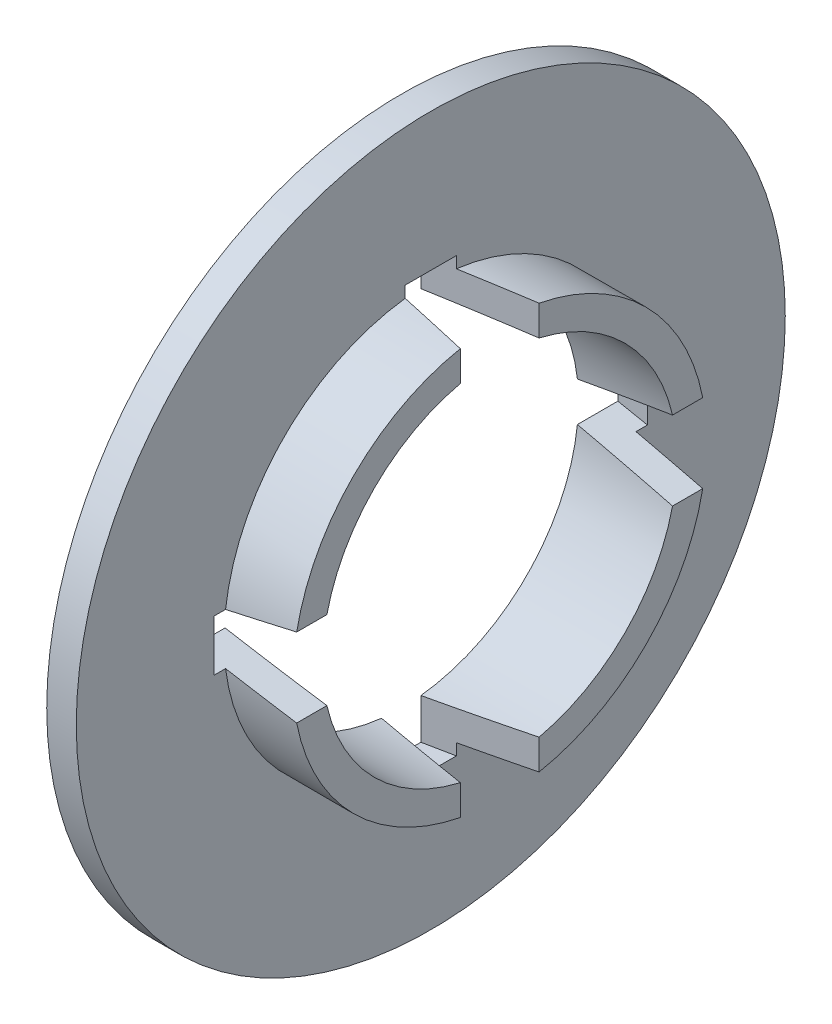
ISO-10303-21;
HEADER;
FILE_DESCRIPTION(('STEP AP214'),'2;1');
FILE_NAME('part.step','',(''),(''),'','','');
FILE_SCHEMA(('AUTOMOTIVE_DESIGN { 1 0 10303 214 1 1 1 1 }'));
ENDSEC;
DATA;
#1=APPLICATION_CONTEXT('core data for automotive mechanical design processes');
#2=APPLICATION_PROTOCOL_DEFINITION('international standard','automotive_design',2000,#1);
#3=PRODUCT_CONTEXT('',#1,'mechanical');
#4=PRODUCT('Part','Part','',(#3));
#5=PRODUCT_RELATED_PRODUCT_CATEGORY('part','',(#4));
#6=PRODUCT_DEFINITION_FORMATION('','',#4);
#7=PRODUCT_DEFINITION_CONTEXT('part definition',#1,'design');
#8=PRODUCT_DEFINITION('design','',#6,#7);
#9=PRODUCT_DEFINITION_SHAPE('','',#8);
#10=(LENGTH_UNIT() NAMED_UNIT(*) SI_UNIT(.MILLI.,.METRE.));
#11=(NAMED_UNIT(*) PLANE_ANGLE_UNIT() SI_UNIT($,.RADIAN.));
#12=(NAMED_UNIT(*) SI_UNIT($,.STERADIAN.) SOLID_ANGLE_UNIT());
#13=UNCERTAINTY_MEASURE_WITH_UNIT(LENGTH_MEASURE(1.E-05),#10,'distance_accuracy_value','');
#14=(GEOMETRIC_REPRESENTATION_CONTEXT(3) GLOBAL_UNCERTAINTY_ASSIGNED_CONTEXT((#13)) GLOBAL_UNIT_ASSIGNED_CONTEXT((#10,
#11,#12)) REPRESENTATION_CONTEXT('',''));
#15=CARTESIAN_POINT('',(0.,0.,0.));
#16=DIRECTION('',(0.,0.,1.));
#17=DIRECTION('',(1.,0.,0.));
#18=AXIS2_PLACEMENT_3D('',#15,#16,#17);
#19=CARTESIAN_POINT('',(1.5,18.,0.));
#20=DIRECTION('',(-1.,0.,0.));
#21=DIRECTION('',(0.,0.,1.));
#22=AXIS2_PLACEMENT_3D('',#19,#20,#21);
#23=PLANE('',#22);
#24=CARTESIAN_POINT('',(1.5,0.,0.));
#25=DIRECTION('',(-1.,0.,0.));
#26=DIRECTION('',(0.,0.,1.));
#27=AXIS2_PLACEMENT_3D('',#24,#25,#26);
#28=CIRCLE('',#27,18.);
#29=CARTESIAN_POINT('',(1.5,0.,18.));
#30=VERTEX_POINT('',#29);
#31=EDGE_CURVE('E11',#30,#30,#28,.T.);
#32=ORIENTED_EDGE('',*,*,#31,.F.);
#33=EDGE_LOOP('',(#32));
#34=FACE_BOUND('',#33,.T.);
#35=DIRECTION('',(0.,0.,1.));
#36=VECTOR('',#35,1.);
#37=CARTESIAN_POINT('',(1.5,1.3,-1.7492331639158E-13));
#38=LINE('',#37,#36);
#39=CARTESIAN_POINT('',(1.5,1.30000000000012,-11.));
#40=VERTEX_POINT('',#39);
#41=CARTESIAN_POINT('',(1.5,1.30000000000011,-10.4192130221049));
#42=VERTEX_POINT('',#41);
#43=EDGE_CURVE('E232',#40,#42,#38,.T.);
#44=ORIENTED_EDGE('',*,*,#43,.F.);
#45=DIRECTION('',(0.,1.,0.));
#46=VECTOR('',#45,1.);
#47=CARTESIAN_POINT('',(1.5,18.0000000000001,-10.9999999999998));
#48=LINE('',#47,#46);
#49=CARTESIAN_POINT('',(1.5,-1.29999999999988,-11.));
#50=VERTEX_POINT('',#49);
#51=EDGE_CURVE('E221',#50,#40,#48,.T.);
#52=ORIENTED_EDGE('',*,*,#51,.F.);
#53=DIRECTION('',(0.,0.,-1.));
#54=VECTOR('',#53,1.);
#55=CARTESIAN_POINT('',(1.5,-1.3,-2.02156886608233E-13));
#56=LINE('',#55,#54);
#57=CARTESIAN_POINT('',(1.5,-1.29999999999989,-10.4192130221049));
#58=VERTEX_POINT('',#57);
#59=EDGE_CURVE('E199',#58,#50,#56,.T.);
#60=ORIENTED_EDGE('',*,*,#59,.F.);
#61=CARTESIAN_POINT('',(1.5,0.,0.));
#62=DIRECTION('',(-1.,0.,0.));
#63=DIRECTION('',(0.,0.,1.));
#64=AXIS2_PLACEMENT_3D('',#61,#62,#63);
#65=CIRCLE('',#64,10.5);
#66=CARTESIAN_POINT('',(1.5,-10.4192130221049,-1.30000000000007));
#67=VERTEX_POINT('',#66);
#68=EDGE_CURVE('E357',#58,#67,#65,.T.);
#69=ORIENTED_EDGE('',*,*,#68,.T.);
#70=DIRECTION('',(0.,1.,0.));
#71=VECTOR('',#70,1.);
#72=CARTESIAN_POINT('',(1.5,18.,-1.29999999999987));
#73=LINE('',#72,#71);
#74=CARTESIAN_POINT('',(1.5,-11.,-1.30000000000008));
#75=VERTEX_POINT('',#74);
#76=EDGE_CURVE('E264',#75,#67,#73,.T.);
#77=ORIENTED_EDGE('',*,*,#76,.F.);
#78=DIRECTION('',(0.,0.,-1.));
#79=VECTOR('',#78,1.);
#80=CARTESIAN_POINT('',(1.5,-11.,-2.02506034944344E-13));
#81=LINE('',#80,#79);
#82=CARTESIAN_POINT('',(1.5,-11.,1.29999999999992));
#83=VERTEX_POINT('',#82);
#84=EDGE_CURVE('E250',#83,#75,#81,.T.);
#85=ORIENTED_EDGE('',*,*,#84,.F.);
#86=DIRECTION('',(0.,-1.,0.));
#87=VECTOR('',#86,1.);
#88=CARTESIAN_POINT('',(1.5,18.,1.30000000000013));
#89=LINE('',#88,#87);
#90=CARTESIAN_POINT('',(1.5,-10.4192130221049,1.29999999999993));
#91=VERTEX_POINT('',#90);
#92=EDGE_CURVE('E256',#91,#83,#89,.T.);
#93=ORIENTED_EDGE('',*,*,#92,.F.);
#94=CARTESIAN_POINT('',(1.5,-1.30000000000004,10.4192130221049));
#95=VERTEX_POINT('',#94);
#96=EDGE_CURVE('E362',#91,#95,#65,.T.);
#97=ORIENTED_EDGE('',*,*,#96,.T.);
#98=DIRECTION('',(0.,0.,-1.));
#99=VECTOR('',#98,1.);
#100=CARTESIAN_POINT('',(1.5,-1.3,0.));
#101=LINE('',#100,#99);
#102=CARTESIAN_POINT('',(1.5,-1.30000000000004,11.));
#103=VERTEX_POINT('',#102);
#104=EDGE_CURVE('E300',#103,#95,#101,.T.);
#105=ORIENTED_EDGE('',*,*,#104,.F.);
#106=DIRECTION('',(0.,-1.,0.));
#107=VECTOR('',#106,1.);
#108=CARTESIAN_POINT('',(1.5,18.,11.0000000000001));
#109=LINE('',#108,#107);
#110=CARTESIAN_POINT('',(1.5,1.29999999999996,11.));
#111=VERTEX_POINT('',#110);
#112=EDGE_CURVE('E286',#111,#103,#109,.T.);
#113=ORIENTED_EDGE('',*,*,#112,.F.);
#114=DIRECTION('',(0.,0.,1.));
#115=VECTOR('',#114,1.);
#116=CARTESIAN_POINT('',(1.5,1.3,0.));
#117=LINE('',#116,#115);
#118=CARTESIAN_POINT('',(1.5,1.29999999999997,10.4192130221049));
#119=VERTEX_POINT('',#118);
#120=EDGE_CURVE('E292',#119,#111,#117,.T.);
#121=ORIENTED_EDGE('',*,*,#120,.F.);
#122=CARTESIAN_POINT('',(1.5,10.4192130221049,1.3));
#123=VERTEX_POINT('',#122);
#124=EDGE_CURVE('E354',#119,#123,#65,.T.);
#125=ORIENTED_EDGE('',*,*,#124,.T.);
#126=DIRECTION('',(0.,-1.,0.));
#127=VECTOR('',#126,1.);
#128=CARTESIAN_POINT('',(1.5,18.,1.3));
#129=LINE('',#128,#127);
#130=CARTESIAN_POINT('',(1.5,11.,1.3));
#131=VERTEX_POINT('',#130);
#132=EDGE_CURVE('E336',#131,#123,#129,.T.);
#133=ORIENTED_EDGE('',*,*,#132,.F.);
#134=DIRECTION('',(0.,0.,1.));
#135=VECTOR('',#134,1.);
#136=CARTESIAN_POINT('',(1.5,11.,0.));
#137=LINE('',#136,#135);
#138=CARTESIAN_POINT('',(1.5,11.,-1.3));
#139=VERTEX_POINT('',#138);
#140=EDGE_CURVE('E322',#139,#131,#137,.T.);
#141=ORIENTED_EDGE('',*,*,#140,.F.);
#142=DIRECTION('',(0.,1.,0.));
#143=VECTOR('',#142,1.);
#144=CARTESIAN_POINT('',(1.5,18.,-1.3));
#145=LINE('',#144,#143);
#146=CARTESIAN_POINT('',(1.5,10.4192130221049,-1.3));
#147=VERTEX_POINT('',#146);
#148=EDGE_CURVE('E328',#147,#139,#145,.T.);
#149=ORIENTED_EDGE('',*,*,#148,.F.);
#150=EDGE_CURVE('E39',#147,#42,#65,.T.);
#151=ORIENTED_EDGE('',*,*,#150,.T.);
#152=EDGE_LOOP('',(#44,#52,#60,#69,#77,#85,#93,#97,#105,#113,#121,#125,#133,#141,#149,#151));
#153=FACE_BOUND('',#152,.T.);
#154=ADVANCED_FACE('F31',(#34,#153),#23,.F.);
#155=CARTESIAN_POINT('',(-80.299649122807,0.,0.));
#156=DIRECTION('',(-1.,0.,0.));
#157=DIRECTION('',(0.,0.,1.));
#158=AXIS2_PLACEMENT_3D('',#155,#156,#157);
#159=CYLINDRICAL_SURFACE('',#158,10.5);
#160=CARTESIAN_POINT('',(-5.00000000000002,0.,0.));
#161=DIRECTION('',(0.196116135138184,-0.98058067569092,0.));
#162=DIRECTION('',(-0.98058067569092,-0.196116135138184,0.));
#163=AXIS2_PLACEMENT_3D('',#160,#161,#162);
#164=ELLIPSE('',#163,53.5397048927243,10.5);
#165=CARTESIAN_POINT('',(5.00000000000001,2.00000000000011,-10.3077640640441));
#166=VERTEX_POINT('',#165);
#167=EDGE_CURVE('E230',#42,#166,#164,.T.);
#168=ORIENTED_EDGE('',*,*,#167,.F.);
#169=ORIENTED_EDGE('',*,*,#150,.F.);
#170=CARTESIAN_POINT('',(-5.,0.,0.));
#171=DIRECTION('',(0.196116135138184,0.,0.98058067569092));
#172=DIRECTION('',(-0.98058067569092,0.,0.196116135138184));
#173=AXIS2_PLACEMENT_3D('',#170,#171,#172);
#174=ELLIPSE('',#173,53.5397048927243,10.5);
#175=CARTESIAN_POINT('',(5.00000000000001,10.3077640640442,-2.));
#176=VERTEX_POINT('',#175);
#177=EDGE_CURVE('E326',#176,#147,#174,.T.);
#178=ORIENTED_EDGE('',*,*,#177,.F.);
#179=CARTESIAN_POINT('',(5.,0.,0.));
#180=DIRECTION('',(-1.,0.,0.));
#181=DIRECTION('',(0.,0.,1.));
#182=AXIS2_PLACEMENT_3D('',#179,#180,#181);
#183=CIRCLE('',#182,10.5);
#184=EDGE_CURVE('E352',#176,#166,#183,.T.);
#185=ORIENTED_EDGE('',*,*,#184,.T.);
#186=EDGE_LOOP('',(#168,#169,#178,#185));
#187=FACE_BOUND('',#186,.T.);
#188=ADVANCED_FACE('F429',(#187),#159,.T.);
#189=CARTESIAN_POINT('',(-5.,0.,0.));
#190=DIRECTION('',(0.196116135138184,0.98058067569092,0.));
#191=DIRECTION('',(-0.98058067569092,0.196116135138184,0.));
#192=AXIS2_PLACEMENT_3D('',#189,#190,#191);
#193=ELLIPSE('',#192,53.5397048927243,10.5);
#194=CARTESIAN_POINT('',(5.00000000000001,-1.99999999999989,-10.3077640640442));
#195=VERTEX_POINT('',#194);
#196=EDGE_CURVE('E225',#195,#58,#193,.T.);
#197=ORIENTED_EDGE('',*,*,#196,.F.);
#198=CARTESIAN_POINT('',(5.00000000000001,-10.3077640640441,-2.00000000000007));
#199=VERTEX_POINT('',#198);
#200=EDGE_CURVE('E355',#195,#199,#183,.T.);
#201=ORIENTED_EDGE('',*,*,#200,.T.);
#202=CARTESIAN_POINT('',(-5.,0.,0.));
#203=DIRECTION('',(0.196116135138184,0.,0.98058067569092));
#204=DIRECTION('',(-0.98058067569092,0.,0.196116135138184));
#205=AXIS2_PLACEMENT_3D('',#202,#203,#204);
#206=ELLIPSE('',#205,53.5397048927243,10.5);
#207=EDGE_CURVE('E261',#67,#199,#206,.T.);
#208=ORIENTED_EDGE('',*,*,#207,.F.);
#209=ORIENTED_EDGE('',*,*,#68,.F.);
#210=EDGE_LOOP('',(#197,#201,#208,#209));
#211=FACE_BOUND('',#210,.T.);
#212=ADVANCED_FACE('F446',(#211),#159,.T.);
#213=CARTESIAN_POINT('',(5.,10.5,0.));
#214=DIRECTION('',(-1.,0.,0.));
#215=DIRECTION('',(0.,0.,1.));
#216=AXIS2_PLACEMENT_3D('',#213,#214,#215);
#217=PLANE('',#216);
#218=DIRECTION('',(0.,0.,1.));
#219=VECTOR('',#218,1.);
#220=CARTESIAN_POINT('',(5.00000000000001,2.00000000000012,-11.));
#221=LINE('',#220,#219);
#222=CARTESIAN_POINT('',(5.,2.00000000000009,-8.7749643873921));
#223=VERTEX_POINT('',#222);
#224=EDGE_CURVE('E216',#166,#223,#221,.T.);
#225=ORIENTED_EDGE('',*,*,#224,.F.);
#226=ORIENTED_EDGE('',*,*,#184,.F.);
#227=DIRECTION('',(0.,-1.,0.));
#228=VECTOR('',#227,1.);
#229=CARTESIAN_POINT('',(5.00000000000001,11.,-2.));
#230=LINE('',#229,#228);
#231=CARTESIAN_POINT('',(5.00000000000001,8.77496438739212,-2.));
#232=VERTEX_POINT('',#231);
#233=EDGE_CURVE('E316',#176,#232,#230,.T.);
#234=ORIENTED_EDGE('',*,*,#233,.T.);
#235=CARTESIAN_POINT('',(5.,0.,0.));
#236=DIRECTION('',(-1.,0.,0.));
#237=DIRECTION('',(0.,0.,1.));
#238=AXIS2_PLACEMENT_3D('',#235,#236,#237);
#239=CIRCLE('',#238,9.);
#240=EDGE_CURVE('E347',#232,#223,#239,.T.);
#241=ORIENTED_EDGE('',*,*,#240,.T.);
#242=EDGE_LOOP('',(#225,#226,#234,#241));
#243=FACE_BOUND('',#242,.T.);
#244=ADVANCED_FACE('F436',(#243),#217,.F.);
#245=DIRECTION('',(0.,0.,1.));
#246=VECTOR('',#245,1.);
#247=CARTESIAN_POINT('',(5.00000000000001,-1.99999999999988,-11.));
#248=LINE('',#247,#246);
#249=CARTESIAN_POINT('',(5.00000000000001,-1.99999999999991,-8.77496438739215));
#250=VERTEX_POINT('',#249);
#251=EDGE_CURVE('E213',#195,#250,#248,.T.);
#252=ORIENTED_EDGE('',*,*,#251,.T.);
#253=CARTESIAN_POINT('',(5.,-8.77496438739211,-2.00000000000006));
#254=VERTEX_POINT('',#253);
#255=EDGE_CURVE('E351',#250,#254,#239,.T.);
#256=ORIENTED_EDGE('',*,*,#255,.T.);
#257=DIRECTION('',(0.,1.,0.));
#258=VECTOR('',#257,1.);
#259=CARTESIAN_POINT('',(5.00000000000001,-11.,-2.00000000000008));
#260=LINE('',#259,#258);
#261=EDGE_CURVE('E247',#199,#254,#260,.T.);
#262=ORIENTED_EDGE('',*,*,#261,.F.);
#263=ORIENTED_EDGE('',*,*,#200,.F.);
#264=EDGE_LOOP('',(#252,#256,#262,#263));
#265=FACE_BOUND('',#264,.T.);
#266=ADVANCED_FACE('F401',(#265),#217,.F.);
#267=CARTESIAN_POINT('',(-80.299649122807,0.,0.));
#268=DIRECTION('',(-1.,0.,0.));
#269=DIRECTION('',(0.,0.,1.));
#270=AXIS2_PLACEMENT_3D('',#267,#268,#269);
#271=CYLINDRICAL_SURFACE('',#270,9.);
#272=CARTESIAN_POINT('',(-5.00000000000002,0.,0.));
#273=DIRECTION('',(0.196116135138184,-0.98058067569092,0.));
#274=DIRECTION('',(-0.98058067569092,-0.196116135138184,0.));
#275=AXIS2_PLACEMENT_3D('',#272,#273,#274);
#276=ELLIPSE('',#275,45.8911756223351,9.);
#277=CARTESIAN_POINT('',(0.,1.00000000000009,-8.94427190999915));
#278=VERTEX_POINT('',#277);
#279=EDGE_CURVE('E228',#223,#278,#276,.F.);
#280=ORIENTED_EDGE('',*,*,#279,.F.);
#281=ORIENTED_EDGE('',*,*,#240,.F.);
#282=CARTESIAN_POINT('',(-5.,0.,0.));
#283=DIRECTION('',(0.196116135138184,0.,0.98058067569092));
#284=DIRECTION('',(-0.98058067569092,0.,0.196116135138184));
#285=AXIS2_PLACEMENT_3D('',#282,#283,#284);
#286=ELLIPSE('',#285,45.8911756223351,9.);
#287=CARTESIAN_POINT('',(0.,8.94427190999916,-1.));
#288=VERTEX_POINT('',#287);
#289=EDGE_CURVE('E324',#288,#232,#286,.F.);
#290=ORIENTED_EDGE('',*,*,#289,.F.);
#291=CARTESIAN_POINT('',(0.,0.,0.));
#292=DIRECTION('',(-1.,0.,0.));
#293=DIRECTION('',(0.,0.,1.));
#294=AXIS2_PLACEMENT_3D('',#291,#292,#293);
#295=CIRCLE('',#294,9.);
#296=EDGE_CURVE('E343',#288,#278,#295,.T.);
#297=ORIENTED_EDGE('',*,*,#296,.T.);
#298=EDGE_LOOP('',(#280,#281,#290,#297));
#299=FACE_BOUND('',#298,.T.);
#300=ADVANCED_FACE('F440',(#299),#271,.F.);
#301=CARTESIAN_POINT('',(-5.,0.,0.));
#302=DIRECTION('',(0.196116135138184,0.98058067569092,0.));
#303=DIRECTION('',(-0.98058067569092,0.196116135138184,0.));
#304=AXIS2_PLACEMENT_3D('',#301,#302,#303);
#305=ELLIPSE('',#304,45.8911756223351,9.);
#306=CARTESIAN_POINT('',(0.,-0.999999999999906,-8.94427190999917));
#307=VERTEX_POINT('',#306);
#308=EDGE_CURVE('E223',#307,#250,#305,.F.);
#309=ORIENTED_EDGE('',*,*,#308,.F.);
#310=CARTESIAN_POINT('',(0.,-8.94427190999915,-1.00000000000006));
#311=VERTEX_POINT('',#310);
#312=EDGE_CURVE('E212',#307,#311,#295,.T.);
#313=ORIENTED_EDGE('',*,*,#312,.T.);
#314=CARTESIAN_POINT('',(-5.,0.,0.));
#315=DIRECTION('',(0.196116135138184,0.,0.98058067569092));
#316=DIRECTION('',(-0.98058067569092,0.,0.196116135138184));
#317=AXIS2_PLACEMENT_3D('',#314,#315,#316);
#318=ELLIPSE('',#317,45.8911756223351,9.);
#319=EDGE_CURVE('E258',#254,#311,#318,.F.);
#320=ORIENTED_EDGE('',*,*,#319,.F.);
#321=ORIENTED_EDGE('',*,*,#255,.F.);
#322=EDGE_LOOP('',(#309,#313,#320,#321));
#323=FACE_BOUND('',#322,.T.);
#324=ADVANCED_FACE('F408',(#323),#271,.F.);
#325=CARTESIAN_POINT('',(0.,18.,0.));
#326=DIRECTION('',(1.,0.,0.));
#327=DIRECTION('',(0.,0.,-1.));
#328=AXIS2_PLACEMENT_3D('',#325,#326,#327);
#329=PLANE('',#328);
#330=CARTESIAN_POINT('',(0.,0.,0.));
#331=DIRECTION('',(-1.,0.,0.));
#332=DIRECTION('',(0.,0.,1.));
#333=AXIS2_PLACEMENT_3D('',#330,#331,#332);
#334=CIRCLE('',#333,18.);
#335=CARTESIAN_POINT('',(0.,0.,18.));
#336=VERTEX_POINT('',#335);
#337=EDGE_CURVE('E339',#336,#336,#334,.T.);
#338=ORIENTED_EDGE('',*,*,#337,.T.);
#339=EDGE_LOOP('',(#338));
#340=FACE_BOUND('',#339,.T.);
#341=DIRECTION('',(0.,0.,1.));
#342=VECTOR('',#341,1.);
#343=CARTESIAN_POINT('',(0.,1.00000000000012,-11.));
#344=LINE('',#343,#342);
#345=CARTESIAN_POINT('',(0.,1.00000000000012,-11.));
#346=VERTEX_POINT('',#345);
#347=EDGE_CURVE('E207',#346,#278,#344,.T.);
#348=ORIENTED_EDGE('',*,*,#347,.T.);
#349=ORIENTED_EDGE('',*,*,#296,.F.);
#350=DIRECTION('',(0.,-1.,0.));
#351=VECTOR('',#350,1.);
#352=CARTESIAN_POINT('',(0.,11.,-1.));
#353=LINE('',#352,#351);
#354=CARTESIAN_POINT('',(0.,11.,-1.));
#355=VERTEX_POINT('',#354);
#356=EDGE_CURVE('E314',#355,#288,#353,.T.);
#357=ORIENTED_EDGE('',*,*,#356,.F.);
#358=DIRECTION('',(0.,0.,1.));
#359=VECTOR('',#358,1.);
#360=CARTESIAN_POINT('',(0.,11.,1.));
#361=LINE('',#360,#359);
#362=CARTESIAN_POINT('',(0.,11.,1.));
#363=VERTEX_POINT('',#362);
#364=EDGE_CURVE('E308',#355,#363,#361,.T.);
#365=ORIENTED_EDGE('',*,*,#364,.T.);
#366=DIRECTION('',(0.,-1.,0.));
#367=VECTOR('',#366,1.);
#368=CARTESIAN_POINT('',(0.,11.,1.));
#369=LINE('',#368,#367);
#370=CARTESIAN_POINT('',(0.,8.94427190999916,1.));
#371=VERTEX_POINT('',#370);
#372=EDGE_CURVE('E311',#363,#371,#369,.T.);
#373=ORIENTED_EDGE('',*,*,#372,.T.);
#374=CARTESIAN_POINT('',(0.,0.999999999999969,8.94427190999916));
#375=VERTEX_POINT('',#374);
#376=EDGE_CURVE('E342',#375,#371,#295,.T.);
#377=ORIENTED_EDGE('',*,*,#376,.F.);
#378=DIRECTION('',(0.,0.,-1.));
#379=VECTOR('',#378,1.);
#380=CARTESIAN_POINT('',(0.,0.999999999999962,11.));
#381=LINE('',#380,#379);
#382=CARTESIAN_POINT('',(0.,0.999999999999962,11.));
#383=VERTEX_POINT('',#382);
#384=EDGE_CURVE('E278',#383,#375,#381,.T.);
#385=ORIENTED_EDGE('',*,*,#384,.F.);
#386=DIRECTION('',(0.,-1.,0.));
#387=VECTOR('',#386,1.);
#388=CARTESIAN_POINT('',(0.,-1.00000000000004,11.));
#389=LINE('',#388,#387);
#390=CARTESIAN_POINT('',(0.,-1.00000000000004,11.));
#391=VERTEX_POINT('',#390);
#392=EDGE_CURVE('E272',#383,#391,#389,.T.);
#393=ORIENTED_EDGE('',*,*,#392,.T.);
#394=DIRECTION('',(0.,0.,-1.));
#395=VECTOR('',#394,1.);
#396=CARTESIAN_POINT('',(0.,-1.00000000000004,11.));
#397=LINE('',#396,#395);
#398=CARTESIAN_POINT('',(0.,-1.00000000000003,8.94427190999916));
#399=VERTEX_POINT('',#398);
#400=EDGE_CURVE('E275',#391,#399,#397,.T.);
#401=ORIENTED_EDGE('',*,*,#400,.T.);
#402=CARTESIAN_POINT('',(0.,-8.94427190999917,0.999999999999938));
#403=VERTEX_POINT('',#402);
#404=EDGE_CURVE('E409',#403,#399,#295,.T.);
#405=ORIENTED_EDGE('',*,*,#404,.F.);
#406=DIRECTION('',(0.,1.,0.));
#407=VECTOR('',#406,1.);
#408=CARTESIAN_POINT('',(0.,-11.,0.999999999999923));
#409=LINE('',#408,#407);
#410=CARTESIAN_POINT('',(0.,-11.,0.999999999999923));
#411=VERTEX_POINT('',#410);
#412=EDGE_CURVE('E242',#411,#403,#409,.T.);
#413=ORIENTED_EDGE('',*,*,#412,.F.);
#414=DIRECTION('',(0.,0.,-1.));
#415=VECTOR('',#414,1.);
#416=CARTESIAN_POINT('',(0.,-11.,-1.00000000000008));
#417=LINE('',#416,#415);
#418=CARTESIAN_POINT('',(0.,-11.,-1.00000000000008));
#419=VERTEX_POINT('',#418);
#420=EDGE_CURVE('E237',#411,#419,#417,.T.);
#421=ORIENTED_EDGE('',*,*,#420,.T.);
#422=DIRECTION('',(0.,1.,0.));
#423=VECTOR('',#422,1.);
#424=CARTESIAN_POINT('',(0.,-11.,-1.00000000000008));
#425=LINE('',#424,#423);
#426=EDGE_CURVE('E240',#419,#311,#425,.T.);
#427=ORIENTED_EDGE('',*,*,#426,.T.);
#428=ORIENTED_EDGE('',*,*,#312,.F.);
#429=DIRECTION('',(0.,0.,1.));
#430=VECTOR('',#429,1.);
#431=CARTESIAN_POINT('',(0.,-0.999999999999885,-11.));
#432=LINE('',#431,#430);
#433=CARTESIAN_POINT('',(0.,-0.999999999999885,-11.));
#434=VERTEX_POINT('',#433);
#435=EDGE_CURVE('E196',#434,#307,#432,.T.);
#436=ORIENTED_EDGE('',*,*,#435,.F.);
#437=DIRECTION('',(0.,1.,0.));
#438=VECTOR('',#437,1.);
#439=CARTESIAN_POINT('',(0.,1.00000000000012,-11.));
#440=LINE('',#439,#438);
#441=EDGE_CURVE('E201',#434,#346,#440,.T.);
#442=ORIENTED_EDGE('',*,*,#441,.T.);
#443=EDGE_LOOP('',(#348,#349,#357,#365,#373,#377,#385,#393,#401,#405,#413,#421,#427,#428,#436,#442));
#444=FACE_BOUND('',#443,.T.);
#445=ADVANCED_FACE('F210',(#340,#444),#329,.F.);
#446=CARTESIAN_POINT('',(-5.00000000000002,0.,0.));
#447=DIRECTION('',(0.196116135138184,0.,-0.98058067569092));
#448=DIRECTION('',(-0.98058067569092,0.,-0.196116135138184));
#449=AXIS2_PLACEMENT_3D('',#446,#447,#448);
#450=ELLIPSE('',#449,53.5397048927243,10.5);
#451=CARTESIAN_POINT('',(5.00000000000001,-10.3077640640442,1.99999999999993));
#452=VERTEX_POINT('',#451);
#453=EDGE_CURVE('E254',#452,#91,#450,.T.);
#454=ORIENTED_EDGE('',*,*,#453,.F.);
#455=CARTESIAN_POINT('',(5.00000000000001,-2.00000000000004,10.3077640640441));
#456=VERTEX_POINT('',#455);
#457=EDGE_CURVE('E380',#452,#456,#183,.T.);
#458=ORIENTED_EDGE('',*,*,#457,.T.);
#459=CARTESIAN_POINT('',(-5.,0.,0.));
#460=DIRECTION('',(0.196116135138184,0.98058067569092,0.));
#461=DIRECTION('',(-0.98058067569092,0.196116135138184,0.));
#462=AXIS2_PLACEMENT_3D('',#459,#460,#461);
#463=ELLIPSE('',#462,53.5397048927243,10.5);
#464=EDGE_CURVE('E297',#95,#456,#463,.T.);
#465=ORIENTED_EDGE('',*,*,#464,.F.);
#466=ORIENTED_EDGE('',*,*,#96,.F.);
#467=EDGE_LOOP('',(#454,#458,#465,#466));
#468=FACE_BOUND('',#467,.T.);
#469=ADVANCED_FACE('F378',(#468),#159,.T.);
#470=DIRECTION('',(0.,1.,0.));
#471=VECTOR('',#470,1.);
#472=CARTESIAN_POINT('',(5.00000000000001,-11.,1.99999999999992));
#473=LINE('',#472,#471);
#474=CARTESIAN_POINT('',(5.00000000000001,-8.77496438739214,1.99999999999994));
#475=VERTEX_POINT('',#474);
#476=EDGE_CURVE('E244',#452,#475,#473,.T.);
#477=ORIENTED_EDGE('',*,*,#476,.T.);
#478=CARTESIAN_POINT('',(5.,-2.00000000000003,8.77496438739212));
#479=VERTEX_POINT('',#478);
#480=EDGE_CURVE('E396',#475,#479,#239,.T.);
#481=ORIENTED_EDGE('',*,*,#480,.T.);
#482=DIRECTION('',(0.,0.,-1.));
#483=VECTOR('',#482,1.);
#484=CARTESIAN_POINT('',(5.00000000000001,-2.00000000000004,11.));
#485=LINE('',#484,#483);
#486=EDGE_CURVE('E283',#456,#479,#485,.T.);
#487=ORIENTED_EDGE('',*,*,#486,.F.);
#488=ORIENTED_EDGE('',*,*,#457,.F.);
#489=EDGE_LOOP('',(#477,#481,#487,#488));
#490=FACE_BOUND('',#489,.T.);
#491=ADVANCED_FACE('F455',(#490),#217,.F.);
#492=CARTESIAN_POINT('',(-5.00000000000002,0.,0.));
#493=DIRECTION('',(0.196116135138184,0.,-0.98058067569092));
#494=DIRECTION('',(-0.98058067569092,0.,-0.196116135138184));
#495=AXIS2_PLACEMENT_3D('',#492,#493,#494);
#496=ELLIPSE('',#495,45.8911756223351,9.);
#497=EDGE_CURVE('E252',#403,#475,#496,.F.);
#498=ORIENTED_EDGE('',*,*,#497,.F.);
#499=ORIENTED_EDGE('',*,*,#404,.T.);
#500=CARTESIAN_POINT('',(-5.,0.,0.));
#501=DIRECTION('',(0.196116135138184,0.98058067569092,0.));
#502=DIRECTION('',(-0.98058067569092,0.196116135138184,0.));
#503=AXIS2_PLACEMENT_3D('',#500,#501,#502);
#504=ELLIPSE('',#503,45.8911756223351,9.);
#505=EDGE_CURVE('E294',#479,#399,#504,.F.);
#506=ORIENTED_EDGE('',*,*,#505,.F.);
#507=ORIENTED_EDGE('',*,*,#480,.F.);
#508=EDGE_LOOP('',(#498,#499,#506,#507));
#509=FACE_BOUND('',#508,.T.);
#510=ADVANCED_FACE('F471',(#509),#271,.F.);
#511=CARTESIAN_POINT('',(-5.00000000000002,0.,0.));
#512=DIRECTION('',(0.196116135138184,-0.98058067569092,0.));
#513=DIRECTION('',(-0.98058067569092,-0.196116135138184,0.));
#514=AXIS2_PLACEMENT_3D('',#511,#512,#513);
#515=ELLIPSE('',#514,53.5397048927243,10.5);
#516=CARTESIAN_POINT('',(5.00000000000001,1.99999999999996,10.3077640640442));
#517=VERTEX_POINT('',#516);
#518=EDGE_CURVE('E290',#517,#119,#515,.T.);
#519=ORIENTED_EDGE('',*,*,#518,.F.);
#520=CARTESIAN_POINT('',(5.00000000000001,10.3077640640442,2.));
#521=VERTEX_POINT('',#520);
#522=EDGE_CURVE('E350',#517,#521,#183,.T.);
#523=ORIENTED_EDGE('',*,*,#522,.T.);
#524=CARTESIAN_POINT('',(-5.,0.,0.));
#525=DIRECTION('',(0.196116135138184,0.,-0.98058067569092));
#526=DIRECTION('',(-0.98058067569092,0.,-0.196116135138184));
#527=AXIS2_PLACEMENT_3D('',#524,#525,#526);
#528=ELLIPSE('',#527,53.5397048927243,10.5);
#529=EDGE_CURVE('E333',#123,#521,#528,.T.);
#530=ORIENTED_EDGE('',*,*,#529,.F.);
#531=ORIENTED_EDGE('',*,*,#124,.F.);
#532=EDGE_LOOP('',(#519,#523,#530,#531));
#533=FACE_BOUND('',#532,.T.);
#534=ADVANCED_FACE('F386',(#533),#159,.T.);
#535=DIRECTION('',(0.,0.,-1.));
#536=VECTOR('',#535,1.);
#537=CARTESIAN_POINT('',(5.00000000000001,1.99999999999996,11.));
#538=LINE('',#537,#536);
#539=CARTESIAN_POINT('',(5.00000000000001,1.99999999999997,8.77496438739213));
#540=VERTEX_POINT('',#539);
#541=EDGE_CURVE('E280',#517,#540,#538,.T.);
#542=ORIENTED_EDGE('',*,*,#541,.T.);
#543=CARTESIAN_POINT('',(5.,8.77496438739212,2.));
#544=VERTEX_POINT('',#543);
#545=EDGE_CURVE('E346',#540,#544,#239,.T.);
#546=ORIENTED_EDGE('',*,*,#545,.T.);
#547=DIRECTION('',(0.,-1.,0.));
#548=VECTOR('',#547,1.);
#549=CARTESIAN_POINT('',(5.00000000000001,11.,2.));
#550=LINE('',#549,#548);
#551=EDGE_CURVE('E319',#521,#544,#550,.T.);
#552=ORIENTED_EDGE('',*,*,#551,.F.);
#553=ORIENTED_EDGE('',*,*,#522,.F.);
#554=EDGE_LOOP('',(#542,#546,#552,#553));
#555=FACE_BOUND('',#554,.T.);
#556=ADVANCED_FACE('F392',(#555),#217,.F.);
#557=CARTESIAN_POINT('',(-5.00000000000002,0.,0.));
#558=DIRECTION('',(0.196116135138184,-0.98058067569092,0.));
#559=DIRECTION('',(-0.98058067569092,-0.196116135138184,0.));
#560=AXIS2_PLACEMENT_3D('',#557,#558,#559);
#561=ELLIPSE('',#560,45.8911756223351,9.);
#562=EDGE_CURVE('E288',#375,#540,#561,.F.);
#563=ORIENTED_EDGE('',*,*,#562,.F.);
#564=ORIENTED_EDGE('',*,*,#376,.T.);
#565=CARTESIAN_POINT('',(-5.,0.,0.));
#566=DIRECTION('',(0.196116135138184,0.,-0.98058067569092));
#567=DIRECTION('',(-0.98058067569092,0.,-0.196116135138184));
#568=AXIS2_PLACEMENT_3D('',#565,#566,#567);
#569=ELLIPSE('',#568,45.8911756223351,9.);
#570=EDGE_CURVE('E330',#544,#371,#569,.F.);
#571=ORIENTED_EDGE('',*,*,#570,.F.);
#572=ORIENTED_EDGE('',*,*,#545,.F.);
#573=EDGE_LOOP('',(#563,#564,#571,#572));
#574=FACE_BOUND('',#573,.T.);
#575=ADVANCED_FACE('F415',(#574),#271,.F.);
#576=CARTESIAN_POINT('',(-80.299649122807,0.,0.));
#577=DIRECTION('',(-1.,0.,0.));
#578=DIRECTION('',(0.,0.,1.));
#579=AXIS2_PLACEMENT_3D('',#576,#577,#578);
#580=CYLINDRICAL_SURFACE('',#579,18.);
#581=ORIENTED_EDGE('',*,*,#337,.F.);
#582=EDGE_LOOP('',(#581));
#583=FACE_BOUND('',#582,.T.);
#584=ORIENTED_EDGE('',*,*,#31,.T.);
#585=EDGE_LOOP('',(#584));
#586=FACE_BOUND('',#585,.T.);
#587=ADVANCED_FACE('F33',(#583,#586),#580,.T.);
#588=CARTESIAN_POINT('',(5.00000000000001,11.,2.));
#589=DIRECTION('',(0.196116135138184,0.,-0.98058067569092));
#590=DIRECTION('',(-0.98058067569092,0.,-0.196116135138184));
#591=AXIS2_PLACEMENT_3D('',#588,#589,#590);
#592=PLANE('',#591);
#593=ORIENTED_EDGE('',*,*,#132,.T.);
#594=ORIENTED_EDGE('',*,*,#529,.T.);
#595=ORIENTED_EDGE('',*,*,#551,.T.);
#596=ORIENTED_EDGE('',*,*,#570,.T.);
#597=ORIENTED_EDGE('',*,*,#372,.F.);
#598=DIRECTION('',(0.98058067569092,0.,0.196116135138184));
#599=VECTOR('',#598,1.);
#600=CARTESIAN_POINT('',(5.00000000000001,11.,2.));
#601=LINE('',#600,#599);
#602=EDGE_CURVE('E303',#363,#131,#601,.T.);
#603=ORIENTED_EDGE('',*,*,#602,.T.);
#604=EDGE_LOOP('',(#593,#594,#595,#596,#597,#603));
#605=FACE_BOUND('',#604,.T.);
#606=ADVANCED_FACE('F390',(#605),#592,.T.);
#607=CARTESIAN_POINT('',(5.00000000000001,11.,-2.));
#608=DIRECTION('',(0.196116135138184,0.,0.98058067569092));
#609=DIRECTION('',(0.98058067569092,0.,-0.196116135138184));
#610=AXIS2_PLACEMENT_3D('',#607,#608,#609);
#611=PLANE('',#610);
#612=ORIENTED_EDGE('',*,*,#148,.T.);
#613=DIRECTION('',(-0.98058067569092,0.,0.196116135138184));
#614=VECTOR('',#613,1.);
#615=CARTESIAN_POINT('',(5.00000000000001,11.,-2.));
#616=LINE('',#615,#614);
#617=EDGE_CURVE('E306',#139,#355,#616,.T.);
#618=ORIENTED_EDGE('',*,*,#617,.T.);
#619=ORIENTED_EDGE('',*,*,#356,.T.);
#620=ORIENTED_EDGE('',*,*,#289,.T.);
#621=ORIENTED_EDGE('',*,*,#233,.F.);
#622=ORIENTED_EDGE('',*,*,#177,.T.);
#623=EDGE_LOOP('',(#612,#618,#619,#620,#621,#622));
#624=FACE_BOUND('',#623,.T.);
#625=ADVANCED_FACE('F468',(#624),#611,.T.);
#626=CARTESIAN_POINT('',(0.,11.,1.));
#627=DIRECTION('',(0.,-1.,0.));
#628=DIRECTION('',(0.,0.,-1.));
#629=AXIS2_PLACEMENT_3D('',#626,#627,#628);
#630=PLANE('',#629);
#631=ORIENTED_EDGE('',*,*,#140,.T.);
#632=ORIENTED_EDGE('',*,*,#602,.F.);
#633=ORIENTED_EDGE('',*,*,#364,.F.);
#634=ORIENTED_EDGE('',*,*,#617,.F.);
#635=EDGE_LOOP('',(#631,#632,#633,#634));
#636=FACE_BOUND('',#635,.T.);
#637=ADVANCED_FACE('F423',(#636),#630,.T.);
#638=CARTESIAN_POINT('',(5.00000000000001,-2.00000000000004,11.));
#639=DIRECTION('',(0.196116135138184,0.98058067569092,0.));
#640=DIRECTION('',(-0.98058067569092,0.196116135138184,0.));
#641=AXIS2_PLACEMENT_3D('',#638,#639,#640);
#642=PLANE('',#641);
#643=ORIENTED_EDGE('',*,*,#104,.T.);
#644=ORIENTED_EDGE('',*,*,#464,.T.);
#645=ORIENTED_EDGE('',*,*,#486,.T.);
#646=ORIENTED_EDGE('',*,*,#505,.T.);
#647=ORIENTED_EDGE('',*,*,#400,.F.);
#648=DIRECTION('',(0.98058067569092,-0.196116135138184,0.));
#649=VECTOR('',#648,1.);
#650=CARTESIAN_POINT('',(5.00000000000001,-2.00000000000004,11.));
#651=LINE('',#650,#649);
#652=EDGE_CURVE('E267',#391,#103,#651,.T.);
#653=ORIENTED_EDGE('',*,*,#652,.T.);
#654=EDGE_LOOP('',(#643,#644,#645,#646,#647,#653));
#655=FACE_BOUND('',#654,.T.);
#656=ADVANCED_FACE('F375',(#655),#642,.T.);
#657=CARTESIAN_POINT('',(5.00000000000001,1.99999999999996,11.));
#658=DIRECTION('',(0.196116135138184,-0.98058067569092,0.));
#659=DIRECTION('',(0.98058067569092,0.196116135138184,0.));
#660=AXIS2_PLACEMENT_3D('',#657,#658,#659);
#661=PLANE('',#660);
#662=ORIENTED_EDGE('',*,*,#120,.T.);
#663=DIRECTION('',(-0.98058067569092,-0.196116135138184,0.));
#664=VECTOR('',#663,1.);
#665=CARTESIAN_POINT('',(5.00000000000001,1.99999999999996,11.));
#666=LINE('',#665,#664);
#667=EDGE_CURVE('E270',#111,#383,#666,.T.);
#668=ORIENTED_EDGE('',*,*,#667,.T.);
#669=ORIENTED_EDGE('',*,*,#384,.T.);
#670=ORIENTED_EDGE('',*,*,#562,.T.);
#671=ORIENTED_EDGE('',*,*,#541,.F.);
#672=ORIENTED_EDGE('',*,*,#518,.T.);
#673=EDGE_LOOP('',(#662,#668,#669,#670,#671,#672));
#674=FACE_BOUND('',#673,.T.);
#675=ADVANCED_FACE('F582',(#674),#661,.T.);
#676=CARTESIAN_POINT('',(0.,-1.00000000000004,11.));
#677=DIRECTION('',(0.,0.,-1.));
#678=DIRECTION('',(0.,1.,0.));
#679=AXIS2_PLACEMENT_3D('',#676,#677,#678);
#680=PLANE('',#679);
#681=ORIENTED_EDGE('',*,*,#112,.T.);
#682=ORIENTED_EDGE('',*,*,#652,.F.);
#683=ORIENTED_EDGE('',*,*,#392,.F.);
#684=ORIENTED_EDGE('',*,*,#667,.F.);
#685=EDGE_LOOP('',(#681,#682,#683,#684));
#686=FACE_BOUND('',#685,.T.);
#687=ADVANCED_FACE('F585',(#686),#680,.T.);
#688=CARTESIAN_POINT('',(5.00000000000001,-11.,-2.00000000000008));
#689=DIRECTION('',(0.196116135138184,0.,0.98058067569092));
#690=DIRECTION('',(0.98058067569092,0.,-0.196116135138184));
#691=AXIS2_PLACEMENT_3D('',#688,#689,#690);
#692=PLANE('',#691);
#693=ORIENTED_EDGE('',*,*,#76,.T.);
#694=ORIENTED_EDGE('',*,*,#207,.T.);
#695=ORIENTED_EDGE('',*,*,#261,.T.);
#696=ORIENTED_EDGE('',*,*,#319,.T.);
#697=ORIENTED_EDGE('',*,*,#426,.F.);
#698=DIRECTION('',(0.98058067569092,0.,-0.196116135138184));
#699=VECTOR('',#698,1.);
#700=CARTESIAN_POINT('',(5.00000000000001,-11.,-2.00000000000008));
#701=LINE('',#700,#699);
#702=EDGE_CURVE('E54',#419,#75,#701,.T.);
#703=ORIENTED_EDGE('',*,*,#702,.T.);
#704=EDGE_LOOP('',(#693,#694,#695,#696,#697,#703));
#705=FACE_BOUND('',#704,.T.);
#706=ADVANCED_FACE('F406',(#705),#692,.T.);
#707=CARTESIAN_POINT('',(5.00000000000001,-11.,1.99999999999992));
#708=DIRECTION('',(0.196116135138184,0.,-0.98058067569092));
#709=DIRECTION('',(-0.98058067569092,0.,-0.196116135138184));
#710=AXIS2_PLACEMENT_3D('',#707,#708,#709);
#711=PLANE('',#710);
#712=ORIENTED_EDGE('',*,*,#92,.T.);
#713=DIRECTION('',(-0.98058067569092,0.,-0.196116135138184));
#714=VECTOR('',#713,1.);
#715=CARTESIAN_POINT('',(5.00000000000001,-11.,1.99999999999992));
#716=LINE('',#715,#714);
#717=EDGE_CURVE('E235',#83,#411,#716,.T.);
#718=ORIENTED_EDGE('',*,*,#717,.T.);
#719=ORIENTED_EDGE('',*,*,#412,.T.);
#720=ORIENTED_EDGE('',*,*,#497,.T.);
#721=ORIENTED_EDGE('',*,*,#476,.F.);
#722=ORIENTED_EDGE('',*,*,#453,.T.);
#723=EDGE_LOOP('',(#712,#718,#719,#720,#721,#722));
#724=FACE_BOUND('',#723,.T.);
#725=ADVANCED_FACE('F592',(#724),#711,.T.);
#726=CARTESIAN_POINT('',(0.,-11.,-1.00000000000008));
#727=DIRECTION('',(0.,1.,0.));
#728=DIRECTION('',(0.,0.,1.));
#729=AXIS2_PLACEMENT_3D('',#726,#727,#728);
#730=PLANE('',#729);
#731=ORIENTED_EDGE('',*,*,#84,.T.);
#732=ORIENTED_EDGE('',*,*,#702,.F.);
#733=ORIENTED_EDGE('',*,*,#420,.F.);
#734=ORIENTED_EDGE('',*,*,#717,.F.);
#735=EDGE_LOOP('',(#731,#732,#733,#734));
#736=FACE_BOUND('',#735,.T.);
#737=ADVANCED_FACE('F595',(#736),#730,.T.);
#738=CARTESIAN_POINT('',(5.00000000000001,2.00000000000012,-11.));
#739=DIRECTION('',(0.196116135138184,-0.98058067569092,0.));
#740=DIRECTION('',(0.98058067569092,0.196116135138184,0.));
#741=AXIS2_PLACEMENT_3D('',#738,#739,#740);
#742=PLANE('',#741);
#743=ORIENTED_EDGE('',*,*,#43,.T.);
#744=ORIENTED_EDGE('',*,*,#167,.T.);
#745=ORIENTED_EDGE('',*,*,#224,.T.);
#746=ORIENTED_EDGE('',*,*,#279,.T.);
#747=ORIENTED_EDGE('',*,*,#347,.F.);
#748=DIRECTION('',(0.98058067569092,0.196116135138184,0.));
#749=VECTOR('',#748,1.);
#750=CARTESIAN_POINT('',(5.00000000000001,2.00000000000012,-11.));
#751=LINE('',#750,#749);
#752=EDGE_CURVE('E46',#346,#40,#751,.T.);
#753=ORIENTED_EDGE('',*,*,#752,.T.);
#754=EDGE_LOOP('',(#743,#744,#745,#746,#747,#753));
#755=FACE_BOUND('',#754,.T.);
#756=ADVANCED_FACE('F433',(#755),#742,.T.);
#757=CARTESIAN_POINT('',(5.00000000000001,-1.99999999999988,-11.));
#758=DIRECTION('',(0.196116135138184,0.98058067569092,0.));
#759=DIRECTION('',(-0.98058067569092,0.196116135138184,0.));
#760=AXIS2_PLACEMENT_3D('',#757,#758,#759);
#761=PLANE('',#760);
#762=ORIENTED_EDGE('',*,*,#59,.T.);
#763=DIRECTION('',(-0.98058067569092,0.196116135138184,0.));
#764=VECTOR('',#763,1.);
#765=CARTESIAN_POINT('',(5.00000000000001,-1.99999999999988,-11.));
#766=LINE('',#765,#764);
#767=EDGE_CURVE('E193',#50,#434,#766,.T.);
#768=ORIENTED_EDGE('',*,*,#767,.T.);
#769=ORIENTED_EDGE('',*,*,#435,.T.);
#770=ORIENTED_EDGE('',*,*,#308,.T.);
#771=ORIENTED_EDGE('',*,*,#251,.F.);
#772=ORIENTED_EDGE('',*,*,#196,.T.);
#773=EDGE_LOOP('',(#762,#768,#769,#770,#771,#772));
#774=FACE_BOUND('',#773,.T.);
#775=ADVANCED_FACE('F194',(#774),#761,.T.);
#776=CARTESIAN_POINT('',(0.,1.00000000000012,-11.));
#777=DIRECTION('',(0.,0.,1.));
#778=DIRECTION('',(0.,-1.,0.));
#779=AXIS2_PLACEMENT_3D('',#776,#777,#778);
#780=PLANE('',#779);
#781=ORIENTED_EDGE('',*,*,#51,.T.);
#782=ORIENTED_EDGE('',*,*,#752,.F.);
#783=ORIENTED_EDGE('',*,*,#441,.F.);
#784=ORIENTED_EDGE('',*,*,#767,.F.);
#785=EDGE_LOOP('',(#781,#782,#783,#784));
#786=FACE_BOUND('',#785,.T.);
#787=ADVANCED_FACE('F204',(#786),#780,.T.);
#788=CLOSED_SHELL('',(#154,#188,#212,#244,#266,#300,#324,#445,#469,#491,#510,#534,#556,#575,
#587,#606,#625,#637,#656,#675,#687,#706,#725,#737,#756,#775,#787));
#789=MANIFOLD_SOLID_BREP('B2',#788);
#790=ADVANCED_BREP_SHAPE_REPRESENTATION('',(#18,#789),#14);
#791=SHAPE_DEFINITION_REPRESENTATION(#9,#790);
ENDSEC;
END-ISO-10303-21;
